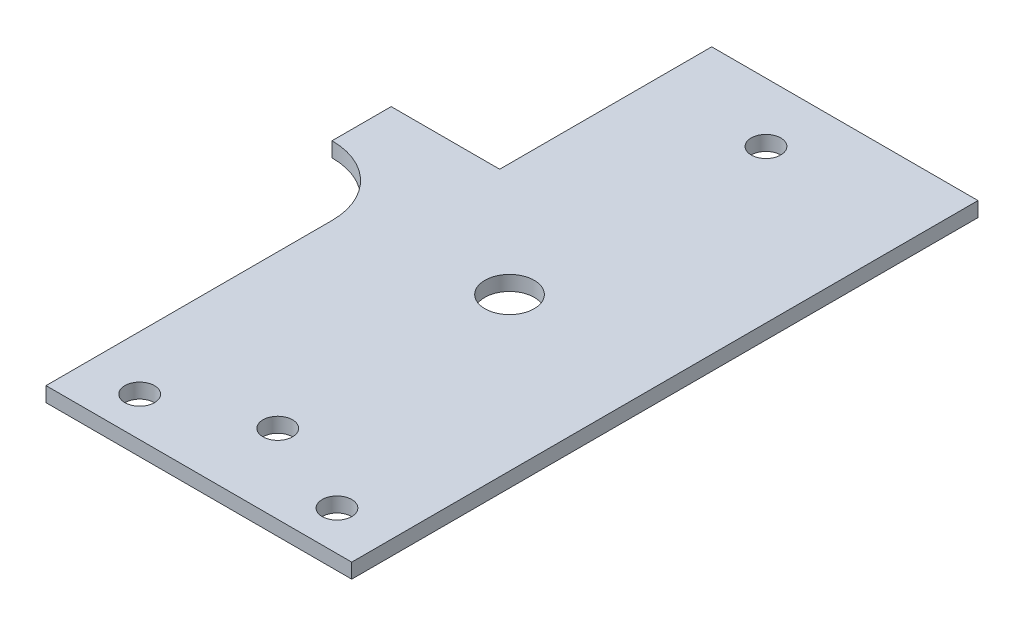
ISO-10303-21;
HEADER;
FILE_DESCRIPTION(('STEP AP214'),'2;1');
FILE_NAME('part.step','',(''),(''),'','','');
FILE_SCHEMA(('AUTOMOTIVE_DESIGN { 1 0 10303 214 1 1 1 1 }'));
ENDSEC;
DATA;
#1=APPLICATION_CONTEXT('core data for automotive mechanical design processes');
#2=APPLICATION_PROTOCOL_DEFINITION('international standard','automotive_design',2000,#1);
#3=PRODUCT_CONTEXT('',#1,'mechanical');
#4=PRODUCT('Part','Part','',(#3));
#5=PRODUCT_RELATED_PRODUCT_CATEGORY('part','',(#4));
#6=PRODUCT_DEFINITION_FORMATION('','',#4);
#7=PRODUCT_DEFINITION_CONTEXT('part definition',#1,'design');
#8=PRODUCT_DEFINITION('design','',#6,#7);
#9=PRODUCT_DEFINITION_SHAPE('','',#8);
#10=(LENGTH_UNIT() NAMED_UNIT(*) SI_UNIT(.MILLI.,.METRE.));
#11=(NAMED_UNIT(*) PLANE_ANGLE_UNIT() SI_UNIT($,.RADIAN.));
#12=(NAMED_UNIT(*) SI_UNIT($,.STERADIAN.) SOLID_ANGLE_UNIT());
#13=UNCERTAINTY_MEASURE_WITH_UNIT(LENGTH_MEASURE(1.E-05),#10,'distance_accuracy_value','');
#14=(GEOMETRIC_REPRESENTATION_CONTEXT(3) GLOBAL_UNCERTAINTY_ASSIGNED_CONTEXT((#13)) GLOBAL_UNIT_ASSIGNED_CONTEXT((#10,
#11,#12)) REPRESENTATION_CONTEXT('',''));
#15=CARTESIAN_POINT('',(0.,0.,0.));
#16=DIRECTION('',(0.,0.,1.));
#17=DIRECTION('',(1.,0.,0.));
#18=AXIS2_PLACEMENT_3D('',#15,#16,#17);
#19=CARTESIAN_POINT('',(-14.,3.,-58.));
#20=DIRECTION('',(0.,1.,0.));
#21=DIRECTION('',(0.,0.,1.));
#22=AXIS2_PLACEMENT_3D('',#19,#20,#21);
#23=PLANE('',#22);
#24=CARTESIAN_POINT('',(31.,3.,-115.));
#25=DIRECTION('',(0.,1.,0.));
#26=DIRECTION('',(0.,0.,1.));
#27=AXIS2_PLACEMENT_3D('',#24,#25,#26);
#28=CIRCLE('',#27,2.99999999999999);
#29=CARTESIAN_POINT('',(31.,3.,-112.));
#30=VERTEX_POINT('',#29);
#31=EDGE_CURVE('E192',#30,#30,#28,.T.);
#32=ORIENTED_EDGE('',*,*,#31,.F.);
#33=EDGE_LOOP('',(#32));
#34=FACE_BOUND('',#33,.T.);
#35=CARTESIAN_POINT('',(51.,3.,-8.));
#36=DIRECTION('',(0.,1.,0.));
#37=DIRECTION('',(0.,0.,1.));
#38=AXIS2_PLACEMENT_3D('',#35,#36,#37);
#39=CIRCLE('',#38,3.);
#40=CARTESIAN_POINT('',(51.,3.,-5.));
#41=VERTEX_POINT('',#40);
#42=EDGE_CURVE('E180',#41,#41,#39,.T.);
#43=ORIENTED_EDGE('',*,*,#42,.F.);
#44=EDGE_LOOP('',(#43));
#45=FACE_BOUND('',#44,.T.);
#46=DIRECTION('',(0.,0.,1.));
#47=VECTOR('',#46,1.);
#48=CARTESIAN_POINT('',(0.,3.,0.));
#49=LINE('',#48,#47);
#50=CARTESIAN_POINT('',(0.,3.,-58.));
#51=VERTEX_POINT('',#50);
#52=CARTESIAN_POINT('',(0.,3.,0.));
#53=VERTEX_POINT('',#52);
#54=EDGE_CURVE('E143',#51,#53,#49,.T.);
#55=ORIENTED_EDGE('',*,*,#54,.T.);
#56=DIRECTION('',(1.,0.,0.));
#57=VECTOR('',#56,1.);
#58=CARTESIAN_POINT('',(0.,3.,0.));
#59=LINE('',#58,#57);
#60=CARTESIAN_POINT('',(62.,3.,0.));
#61=VERTEX_POINT('',#60);
#62=EDGE_CURVE('E91',#53,#61,#59,.T.);
#63=ORIENTED_EDGE('',*,*,#62,.T.);
#64=DIRECTION('',(0.,0.,-1.));
#65=VECTOR('',#64,1.);
#66=CARTESIAN_POINT('',(62.,3.,0.));
#67=LINE('',#66,#65);
#68=CARTESIAN_POINT('',(62.,3.,-127.));
#69=VERTEX_POINT('',#68);
#70=EDGE_CURVE('E158',#61,#69,#67,.T.);
#71=ORIENTED_EDGE('',*,*,#70,.T.);
#72=DIRECTION('',(-1.,0.,0.));
#73=VECTOR('',#72,1.);
#74=CARTESIAN_POINT('',(8.,3.,-127.));
#75=LINE('',#74,#73);
#76=CARTESIAN_POINT('',(8.,3.,-127.));
#77=VERTEX_POINT('',#76);
#78=EDGE_CURVE('E171',#69,#77,#75,.T.);
#79=ORIENTED_EDGE('',*,*,#78,.T.);
#80=DIRECTION('',(0.,0.,1.));
#81=VECTOR('',#80,1.);
#82=CARTESIAN_POINT('',(8.,3.,-127.));
#83=LINE('',#82,#81);
#84=CARTESIAN_POINT('',(8.,3.,-84.));
#85=VERTEX_POINT('',#84);
#86=EDGE_CURVE('E110',#77,#85,#83,.T.);
#87=ORIENTED_EDGE('',*,*,#86,.T.);
#88=DIRECTION('',(-1.,0.,0.));
#89=VECTOR('',#88,1.);
#90=CARTESIAN_POINT('',(8.,3.,-84.));
#91=LINE('',#90,#89);
#92=CARTESIAN_POINT('',(-14.,3.,-84.));
#93=VERTEX_POINT('',#92);
#94=EDGE_CURVE('E104',#85,#93,#91,.T.);
#95=ORIENTED_EDGE('',*,*,#94,.T.);
#96=DIRECTION('',(0.,0.,1.));
#97=VECTOR('',#96,1.);
#98=CARTESIAN_POINT('',(-14.,3.,-84.));
#99=LINE('',#98,#97);
#100=CARTESIAN_POINT('',(-14.,3.,-72.));
#101=VERTEX_POINT('',#100);
#102=EDGE_CURVE('E108',#93,#101,#99,.T.);
#103=ORIENTED_EDGE('',*,*,#102,.T.);
#104=CARTESIAN_POINT('',(-14.,3.,-58.));
#105=DIRECTION('',(0.,-1.,0.));
#106=DIRECTION('',(0.,0.,1.));
#107=AXIS2_PLACEMENT_3D('',#104,#105,#106);
#108=CIRCLE('',#107,14.);
#109=EDGE_CURVE('E48',#101,#51,#108,.T.);
#110=ORIENTED_EDGE('',*,*,#109,.T.);
#111=EDGE_LOOP('',(#55,#63,#71,#79,#87,#95,#103,#110));
#112=FACE_BOUND('',#111,.T.);
#113=CARTESIAN_POINT('',(31.,3.,-16.));
#114=DIRECTION('',(0.,1.,0.));
#115=DIRECTION('',(0.,0.,1.));
#116=AXIS2_PLACEMENT_3D('',#113,#114,#115);
#117=CIRCLE('',#116,2.99999999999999);
#118=CARTESIAN_POINT('',(31.,3.,-13.));
#119=VERTEX_POINT('',#118);
#120=EDGE_CURVE('E132',#119,#119,#117,.T.);
#121=ORIENTED_EDGE('',*,*,#120,.F.);
#122=EDGE_LOOP('',(#121));
#123=FACE_BOUND('',#122,.T.);
#124=CARTESIAN_POINT('',(11.,3.,-8.));
#125=DIRECTION('',(0.,1.,0.));
#126=DIRECTION('',(0.,0.,1.));
#127=AXIS2_PLACEMENT_3D('',#124,#125,#126);
#128=CIRCLE('',#127,3.);
#129=CARTESIAN_POINT('',(11.,3.,-5.));
#130=VERTEX_POINT('',#129);
#131=EDGE_CURVE('E186',#130,#130,#128,.T.);
#132=ORIENTED_EDGE('',*,*,#131,.F.);
#133=EDGE_LOOP('',(#132));
#134=FACE_BOUND('',#133,.T.);
#135=CARTESIAN_POINT('',(31.,3.,-63.));
#136=DIRECTION('',(0.,1.,0.));
#137=DIRECTION('',(0.,0.,1.));
#138=AXIS2_PLACEMENT_3D('',#135,#136,#137);
#139=CIRCLE('',#138,5.);
#140=CARTESIAN_POINT('',(31.,3.,-58.));
#141=VERTEX_POINT('',#140);
#142=EDGE_CURVE('E198',#141,#141,#139,.T.);
#143=ORIENTED_EDGE('',*,*,#142,.F.);
#144=EDGE_LOOP('',(#143));
#145=FACE_BOUND('',#144,.T.);
#146=ADVANCED_FACE('F31',(#34,#45,#112,#123,#134,#145),#23,.T.);
#147=CARTESIAN_POINT('',(-14.,0.,-58.));
#148=DIRECTION('',(0.,1.,0.));
#149=DIRECTION('',(0.,0.,1.));
#150=AXIS2_PLACEMENT_3D('',#147,#148,#149);
#151=PLANE('',#150);
#152=CARTESIAN_POINT('',(31.,0.,-115.));
#153=DIRECTION('',(0.,1.,0.));
#154=DIRECTION('',(0.,0.,1.));
#155=AXIS2_PLACEMENT_3D('',#152,#153,#154);
#156=CIRCLE('',#155,2.99999999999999);
#157=CARTESIAN_POINT('',(31.,0.,-112.));
#158=VERTEX_POINT('',#157);
#159=EDGE_CURVE('E195',#158,#158,#156,.T.);
#160=ORIENTED_EDGE('',*,*,#159,.T.);
#161=EDGE_LOOP('',(#160));
#162=FACE_BOUND('',#161,.T.);
#163=CARTESIAN_POINT('',(51.,0.,-8.));
#164=DIRECTION('',(0.,1.,0.));
#165=DIRECTION('',(0.,0.,1.));
#166=AXIS2_PLACEMENT_3D('',#163,#164,#165);
#167=CIRCLE('',#166,3.);
#168=CARTESIAN_POINT('',(51.,0.,-5.));
#169=VERTEX_POINT('',#168);
#170=EDGE_CURVE('E183',#169,#169,#167,.T.);
#171=ORIENTED_EDGE('',*,*,#170,.T.);
#172=EDGE_LOOP('',(#171));
#173=FACE_BOUND('',#172,.T.);
#174=DIRECTION('',(0.,0.,1.));
#175=VECTOR('',#174,1.);
#176=CARTESIAN_POINT('',(0.,0.,0.));
#177=LINE('',#176,#175);
#178=CARTESIAN_POINT('',(0.,0.,-58.));
#179=VERTEX_POINT('',#178);
#180=CARTESIAN_POINT('',(0.,0.,0.));
#181=VERTEX_POINT('',#180);
#182=EDGE_CURVE('E128',#179,#181,#177,.T.);
#183=ORIENTED_EDGE('',*,*,#182,.F.);
#184=CARTESIAN_POINT('',(-14.,0.,-58.));
#185=DIRECTION('',(0.,-1.,0.));
#186=DIRECTION('',(0.,0.,1.));
#187=AXIS2_PLACEMENT_3D('',#184,#185,#186);
#188=CIRCLE('',#187,14.);
#189=CARTESIAN_POINT('',(-14.,0.,-72.));
#190=VERTEX_POINT('',#189);
#191=EDGE_CURVE('E83',#190,#179,#188,.T.);
#192=ORIENTED_EDGE('',*,*,#191,.F.);
#193=DIRECTION('',(0.,0.,1.));
#194=VECTOR('',#193,1.);
#195=CARTESIAN_POINT('',(-14.,0.,-84.));
#196=LINE('',#195,#194);
#197=CARTESIAN_POINT('',(-14.,0.,-84.));
#198=VERTEX_POINT('',#197);
#199=EDGE_CURVE('E77',#198,#190,#196,.T.);
#200=ORIENTED_EDGE('',*,*,#199,.F.);
#201=DIRECTION('',(-1.,0.,0.));
#202=VECTOR('',#201,1.);
#203=CARTESIAN_POINT('',(8.,0.,-84.));
#204=LINE('',#203,#202);
#205=CARTESIAN_POINT('',(8.,0.,-84.));
#206=VERTEX_POINT('',#205);
#207=EDGE_CURVE('E118',#206,#198,#204,.T.);
#208=ORIENTED_EDGE('',*,*,#207,.F.);
#209=DIRECTION('',(0.,0.,1.));
#210=VECTOR('',#209,1.);
#211=CARTESIAN_POINT('',(8.,0.,-127.));
#212=LINE('',#211,#210);
#213=CARTESIAN_POINT('',(8.,0.,-127.));
#214=VERTEX_POINT('',#213);
#215=EDGE_CURVE('E138',#214,#206,#212,.T.);
#216=ORIENTED_EDGE('',*,*,#215,.F.);
#217=DIRECTION('',(-1.,0.,0.));
#218=VECTOR('',#217,1.);
#219=CARTESIAN_POINT('',(8.,0.,-127.));
#220=LINE('',#219,#218);
#221=CARTESIAN_POINT('',(62.,0.,-127.));
#222=VERTEX_POINT('',#221);
#223=EDGE_CURVE('E136',#222,#214,#220,.T.);
#224=ORIENTED_EDGE('',*,*,#223,.F.);
#225=DIRECTION('',(0.,0.,-1.));
#226=VECTOR('',#225,1.);
#227=CARTESIAN_POINT('',(62.,0.,0.));
#228=LINE('',#227,#226);
#229=CARTESIAN_POINT('',(62.,0.,0.));
#230=VERTEX_POINT('',#229);
#231=EDGE_CURVE('E134',#230,#222,#228,.T.);
#232=ORIENTED_EDGE('',*,*,#231,.F.);
#233=DIRECTION('',(1.,0.,0.));
#234=VECTOR('',#233,1.);
#235=CARTESIAN_POINT('',(0.,0.,0.));
#236=LINE('',#235,#234);
#237=EDGE_CURVE('E131',#181,#230,#236,.T.);
#238=ORIENTED_EDGE('',*,*,#237,.F.);
#239=EDGE_LOOP('',(#183,#192,#200,#208,#216,#224,#232,#238));
#240=FACE_BOUND('',#239,.T.);
#241=CARTESIAN_POINT('',(31.,0.,-16.));
#242=DIRECTION('',(0.,1.,0.));
#243=DIRECTION('',(0.,0.,1.));
#244=AXIS2_PLACEMENT_3D('',#241,#242,#243);
#245=CIRCLE('',#244,2.99999999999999);
#246=CARTESIAN_POINT('',(31.,0.,-13.));
#247=VERTEX_POINT('',#246);
#248=EDGE_CURVE('E177',#247,#247,#245,.T.);
#249=ORIENTED_EDGE('',*,*,#248,.T.);
#250=EDGE_LOOP('',(#249));
#251=FACE_BOUND('',#250,.T.);
#252=CARTESIAN_POINT('',(11.,0.,-8.));
#253=DIRECTION('',(0.,1.,0.));
#254=DIRECTION('',(0.,0.,1.));
#255=AXIS2_PLACEMENT_3D('',#252,#253,#254);
#256=CIRCLE('',#255,3.);
#257=CARTESIAN_POINT('',(11.,0.,-5.));
#258=VERTEX_POINT('',#257);
#259=EDGE_CURVE('E189',#258,#258,#256,.T.);
#260=ORIENTED_EDGE('',*,*,#259,.T.);
#261=EDGE_LOOP('',(#260));
#262=FACE_BOUND('',#261,.T.);
#263=CARTESIAN_POINT('',(31.,0.,-63.));
#264=DIRECTION('',(0.,1.,0.));
#265=DIRECTION('',(0.,0.,1.));
#266=AXIS2_PLACEMENT_3D('',#263,#264,#265);
#267=CIRCLE('',#266,5.);
#268=CARTESIAN_POINT('',(31.,0.,-58.));
#269=VERTEX_POINT('',#268);
#270=EDGE_CURVE('E201',#269,#269,#267,.T.);
#271=ORIENTED_EDGE('',*,*,#270,.T.);
#272=EDGE_LOOP('',(#271));
#273=FACE_BOUND('',#272,.T.);
#274=ADVANCED_FACE('F162',(#162,#173,#240,#251,#262,#273),#151,.F.);
#275=CARTESIAN_POINT('',(0.,3.,0.));
#276=DIRECTION('',(1.,0.,0.));
#277=DIRECTION('',(0.,0.,-1.));
#278=AXIS2_PLACEMENT_3D('',#275,#276,#277);
#279=PLANE('',#278);
#280=ORIENTED_EDGE('',*,*,#182,.T.);
#281=DIRECTION('',(0.,-1.,0.));
#282=VECTOR('',#281,1.);
#283=CARTESIAN_POINT('',(0.,3.,0.));
#284=LINE('',#283,#282);
#285=EDGE_CURVE('E11',#53,#181,#284,.T.);
#286=ORIENTED_EDGE('',*,*,#285,.F.);
#287=ORIENTED_EDGE('',*,*,#54,.F.);
#288=DIRECTION('',(0.,-1.,0.));
#289=VECTOR('',#288,1.);
#290=CARTESIAN_POINT('',(0.,3.,-58.));
#291=LINE('',#290,#289);
#292=EDGE_CURVE('E124',#51,#179,#291,.T.);
#293=ORIENTED_EDGE('',*,*,#292,.T.);
#294=EDGE_LOOP('',(#280,#286,#287,#293));
#295=FACE_BOUND('',#294,.T.);
#296=ADVANCED_FACE('F33',(#295),#279,.F.);
#297=CARTESIAN_POINT('',(0.,3.,0.));
#298=DIRECTION('',(0.,0.,-1.));
#299=DIRECTION('',(-1.,0.,0.));
#300=AXIS2_PLACEMENT_3D('',#297,#298,#299);
#301=PLANE('',#300);
#302=ORIENTED_EDGE('',*,*,#237,.T.);
#303=DIRECTION('',(0.,-1.,0.));
#304=VECTOR('',#303,1.);
#305=CARTESIAN_POINT('',(62.,3.,0.));
#306=LINE('',#305,#304);
#307=EDGE_CURVE('E40',#61,#230,#306,.T.);
#308=ORIENTED_EDGE('',*,*,#307,.F.);
#309=ORIENTED_EDGE('',*,*,#62,.F.);
#310=ORIENTED_EDGE('',*,*,#285,.T.);
#311=EDGE_LOOP('',(#302,#308,#309,#310));
#312=FACE_BOUND('',#311,.T.);
#313=ADVANCED_FACE('F236',(#312),#301,.F.);
#314=CARTESIAN_POINT('',(62.,3.,0.));
#315=DIRECTION('',(-1.,0.,0.));
#316=DIRECTION('',(0.,0.,1.));
#317=AXIS2_PLACEMENT_3D('',#314,#315,#316);
#318=PLANE('',#317);
#319=ORIENTED_EDGE('',*,*,#231,.T.);
#320=DIRECTION('',(0.,-1.,0.));
#321=VECTOR('',#320,1.);
#322=CARTESIAN_POINT('',(62.,3.,-127.));
#323=LINE('',#322,#321);
#324=EDGE_CURVE('E150',#69,#222,#323,.T.);
#325=ORIENTED_EDGE('',*,*,#324,.F.);
#326=ORIENTED_EDGE('',*,*,#70,.F.);
#327=ORIENTED_EDGE('',*,*,#307,.T.);
#328=EDGE_LOOP('',(#319,#325,#326,#327));
#329=FACE_BOUND('',#328,.T.);
#330=ADVANCED_FACE('F156',(#329),#318,.F.);
#331=CARTESIAN_POINT('',(8.,3.,-127.));
#332=DIRECTION('',(0.,0.,1.));
#333=DIRECTION('',(1.,0.,0.));
#334=AXIS2_PLACEMENT_3D('',#331,#332,#333);
#335=PLANE('',#334);
#336=ORIENTED_EDGE('',*,*,#223,.T.);
#337=DIRECTION('',(0.,-1.,0.));
#338=VECTOR('',#337,1.);
#339=CARTESIAN_POINT('',(8.,3.,-127.));
#340=LINE('',#339,#338);
#341=EDGE_CURVE('E147',#77,#214,#340,.T.);
#342=ORIENTED_EDGE('',*,*,#341,.F.);
#343=ORIENTED_EDGE('',*,*,#78,.F.);
#344=ORIENTED_EDGE('',*,*,#324,.T.);
#345=EDGE_LOOP('',(#336,#342,#343,#344));
#346=FACE_BOUND('',#345,.T.);
#347=ADVANCED_FACE('F167',(#346),#335,.F.);
#348=CARTESIAN_POINT('',(8.,3.,-127.));
#349=DIRECTION('',(1.,0.,0.));
#350=DIRECTION('',(0.,0.,-1.));
#351=AXIS2_PLACEMENT_3D('',#348,#349,#350);
#352=PLANE('',#351);
#353=ORIENTED_EDGE('',*,*,#215,.T.);
#354=DIRECTION('',(0.,-1.,0.));
#355=VECTOR('',#354,1.);
#356=CARTESIAN_POINT('',(8.,3.,-84.));
#357=LINE('',#356,#355);
#358=EDGE_CURVE('E119',#85,#206,#357,.T.);
#359=ORIENTED_EDGE('',*,*,#358,.F.);
#360=ORIENTED_EDGE('',*,*,#86,.F.);
#361=ORIENTED_EDGE('',*,*,#341,.T.);
#362=EDGE_LOOP('',(#353,#359,#360,#361));
#363=FACE_BOUND('',#362,.T.);
#364=ADVANCED_FACE('F170',(#363),#352,.F.);
#365=CARTESIAN_POINT('',(8.,3.,-84.));
#366=DIRECTION('',(0.,0.,1.));
#367=DIRECTION('',(1.,0.,0.));
#368=AXIS2_PLACEMENT_3D('',#365,#366,#367);
#369=PLANE('',#368);
#370=ORIENTED_EDGE('',*,*,#207,.T.);
#371=DIRECTION('',(0.,-1.,0.));
#372=VECTOR('',#371,1.);
#373=CARTESIAN_POINT('',(-14.,3.,-84.));
#374=LINE('',#373,#372);
#375=EDGE_CURVE('E115',#93,#198,#374,.T.);
#376=ORIENTED_EDGE('',*,*,#375,.F.);
#377=ORIENTED_EDGE('',*,*,#94,.F.);
#378=ORIENTED_EDGE('',*,*,#358,.T.);
#379=EDGE_LOOP('',(#370,#376,#377,#378));
#380=FACE_BOUND('',#379,.T.);
#381=ADVANCED_FACE('F116',(#380),#369,.F.);
#382=CARTESIAN_POINT('',(-14.,3.,-84.));
#383=DIRECTION('',(1.,0.,0.));
#384=DIRECTION('',(0.,0.,-1.));
#385=AXIS2_PLACEMENT_3D('',#382,#383,#384);
#386=PLANE('',#385);
#387=ORIENTED_EDGE('',*,*,#199,.T.);
#388=DIRECTION('',(0.,-1.,0.));
#389=VECTOR('',#388,1.);
#390=CARTESIAN_POINT('',(-14.,3.,-72.));
#391=LINE('',#390,#389);
#392=EDGE_CURVE('E120',#101,#190,#391,.T.);
#393=ORIENTED_EDGE('',*,*,#392,.F.);
#394=ORIENTED_EDGE('',*,*,#102,.F.);
#395=ORIENTED_EDGE('',*,*,#375,.T.);
#396=EDGE_LOOP('',(#387,#393,#394,#395));
#397=FACE_BOUND('',#396,.T.);
#398=ADVANCED_FACE('F122',(#397),#386,.F.);
#399=CARTESIAN_POINT('',(-14.,3.,-58.));
#400=DIRECTION('',(0.,-1.,0.));
#401=DIRECTION('',(0.,0.,-1.));
#402=AXIS2_PLACEMENT_3D('',#399,#400,#401);
#403=CYLINDRICAL_SURFACE('',#402,14.);
#404=ORIENTED_EDGE('',*,*,#191,.T.);
#405=ORIENTED_EDGE('',*,*,#292,.F.);
#406=ORIENTED_EDGE('',*,*,#109,.F.);
#407=ORIENTED_EDGE('',*,*,#392,.T.);
#408=EDGE_LOOP('',(#404,#405,#406,#407));
#409=FACE_BOUND('',#408,.T.);
#410=ADVANCED_FACE('F224',(#409),#403,.F.);
#411=CARTESIAN_POINT('',(31.,3.,-16.));
#412=DIRECTION('',(0.,-1.,0.));
#413=DIRECTION('',(0.,0.,-1.));
#414=AXIS2_PLACEMENT_3D('',#411,#412,#413);
#415=CYLINDRICAL_SURFACE('',#414,2.99999999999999);
#416=ORIENTED_EDGE('',*,*,#120,.T.);
#417=EDGE_LOOP('',(#416));
#418=FACE_BOUND('',#417,.T.);
#419=ORIENTED_EDGE('',*,*,#248,.F.);
#420=EDGE_LOOP('',(#419));
#421=FACE_BOUND('',#420,.T.);
#422=ADVANCED_FACE('F221',(#418,#421),#415,.F.);
#423=CARTESIAN_POINT('',(51.,3.,-8.));
#424=DIRECTION('',(0.,-1.,0.));
#425=DIRECTION('',(0.,0.,-1.));
#426=AXIS2_PLACEMENT_3D('',#423,#424,#425);
#427=CYLINDRICAL_SURFACE('',#426,3.);
#428=ORIENTED_EDGE('',*,*,#42,.T.);
#429=EDGE_LOOP('',(#428));
#430=FACE_BOUND('',#429,.T.);
#431=ORIENTED_EDGE('',*,*,#170,.F.);
#432=EDGE_LOOP('',(#431));
#433=FACE_BOUND('',#432,.T.);
#434=ADVANCED_FACE('F300',(#430,#433),#427,.F.);
#435=CARTESIAN_POINT('',(11.,3.,-8.));
#436=DIRECTION('',(0.,-1.,0.));
#437=DIRECTION('',(0.,0.,-1.));
#438=AXIS2_PLACEMENT_3D('',#435,#436,#437);
#439=CYLINDRICAL_SURFACE('',#438,3.);
#440=ORIENTED_EDGE('',*,*,#131,.T.);
#441=EDGE_LOOP('',(#440));
#442=FACE_BOUND('',#441,.T.);
#443=ORIENTED_EDGE('',*,*,#259,.F.);
#444=EDGE_LOOP('',(#443));
#445=FACE_BOUND('',#444,.T.);
#446=ADVANCED_FACE('F308',(#442,#445),#439,.F.);
#447=CARTESIAN_POINT('',(31.,3.,-115.));
#448=DIRECTION('',(0.,-1.,0.));
#449=DIRECTION('',(0.,0.,-1.));
#450=AXIS2_PLACEMENT_3D('',#447,#448,#449);
#451=CYLINDRICAL_SURFACE('',#450,2.99999999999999);
#452=ORIENTED_EDGE('',*,*,#31,.T.);
#453=EDGE_LOOP('',(#452));
#454=FACE_BOUND('',#453,.T.);
#455=ORIENTED_EDGE('',*,*,#159,.F.);
#456=EDGE_LOOP('',(#455));
#457=FACE_BOUND('',#456,.T.);
#458=ADVANCED_FACE('F316',(#454,#457),#451,.F.);
#459=CARTESIAN_POINT('',(31.,3.,-63.));
#460=DIRECTION('',(0.,-1.,0.));
#461=DIRECTION('',(0.,0.,-1.));
#462=AXIS2_PLACEMENT_3D('',#459,#460,#461);
#463=CYLINDRICAL_SURFACE('',#462,5.);
#464=ORIENTED_EDGE('',*,*,#142,.T.);
#465=EDGE_LOOP('',(#464));
#466=FACE_BOUND('',#465,.T.);
#467=ORIENTED_EDGE('',*,*,#270,.F.);
#468=EDGE_LOOP('',(#467));
#469=FACE_BOUND('',#468,.T.);
#470=ADVANCED_FACE('F207',(#466,#469),#463,.F.);
#471=CLOSED_SHELL('',(#146,#274,#296,#313,#330,#347,#364,#381,#398,#410,#422,#434,#446,#458,#470));
#472=MANIFOLD_SOLID_BREP('B2',#471);
#473=ADVANCED_BREP_SHAPE_REPRESENTATION('',(#18,#472),#14);
#474=SHAPE_DEFINITION_REPRESENTATION(#9,#473);
ENDSEC;
END-ISO-10303-21;
